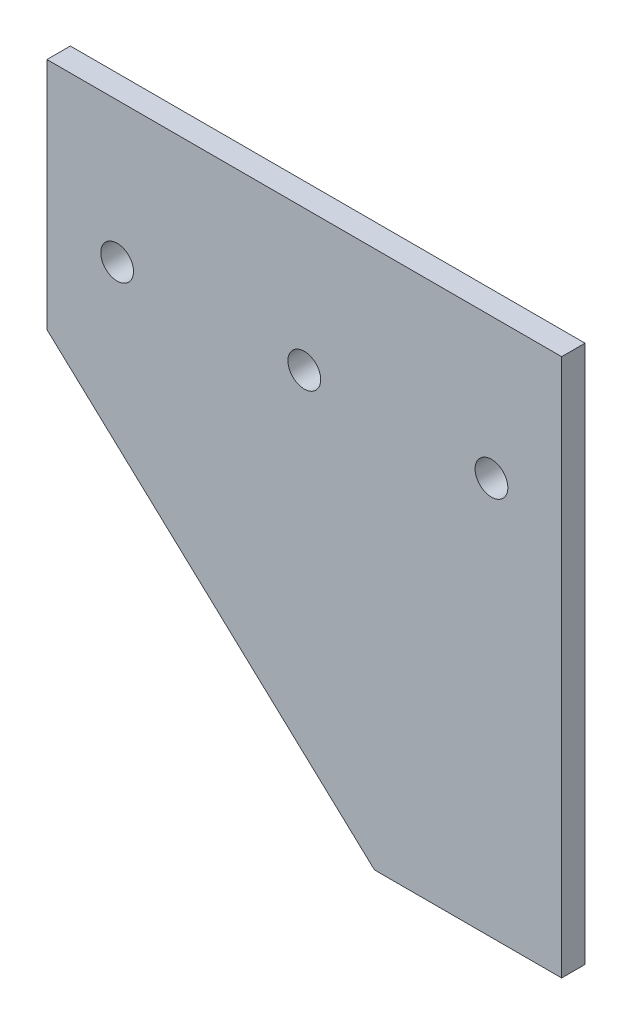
from build123d import *

# Parameters (mm, degrees)
ESQUISSE1_R      = 7
EXTRUSION1_DEPTH = 10


with BuildPart() as part:
    # Esquisse1 → Extrusion1 (new body)
    with BuildSketch(Plane.XY):
        Polygon((-110, 15), (30, -115), (110, -115), (110, 115), (-110, 115), align=None)
        with Locations((-80, 55)):
            Circle(ESQUISSE1_R, mode=Mode.SUBTRACT)
        with Locations((0, 55)):
            Circle(ESQUISSE1_R, mode=Mode.SUBTRACT)
        with Locations((80, 55)):
            Circle(ESQUISSE1_R, mode=Mode.SUBTRACT)
    extrude(amount=EXTRUSION1_DEPTH)


solid = part.part
